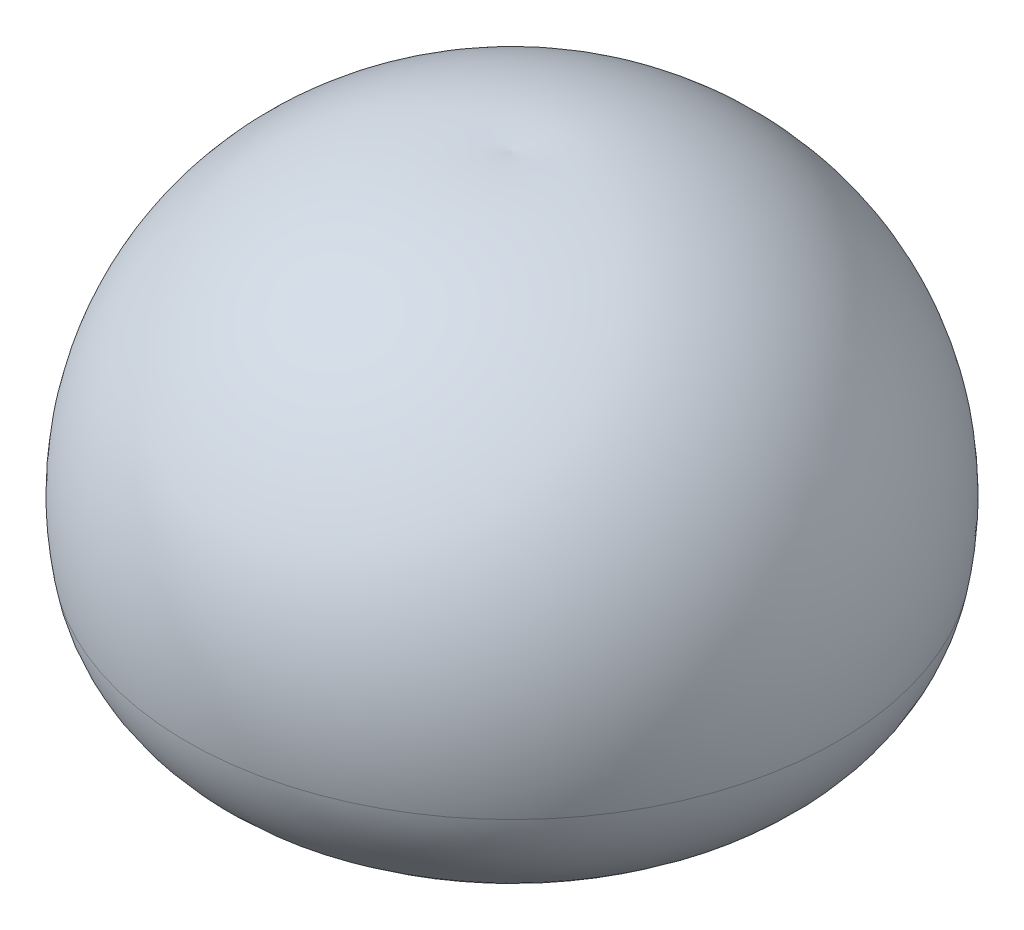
from build123d import *


with BuildPart() as part:
    # Sketch 1 → Revolve 1 (revolve)
    with BuildSketch(Plane.XY, mode=Mode.PRIVATE) as revolve_1_sk:
        with BuildLine():
            Line((0, 3044.927952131), (0, 1312.795284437))
            ThreePointArc((0, 1312.795284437), (84.599361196, 1220.166453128), (159.730627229, 1119.705290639))
            ThreePointArc((159.730627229, 1119.705290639), (770.591257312, 606.867638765), (159.469926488, 94.340677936))
            ThreePointArc((159.469926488, 94.340677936), (1446.745441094, -876.107013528), (2663.480859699, 181.438207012))
            ThreePointArc((2663.480859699, 181.438207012), (2044.45137512, 2276.11262715), (0, 3044.927952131))
        make_face()
    revolve(revolve_1_sk.sketch.rotate(Axis((0, 3713.080739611, 0), (0, -1, 0)), 180), axis=Axis((0, 3713.080739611, 0), (0, -1, 0)))


solid = part.part
